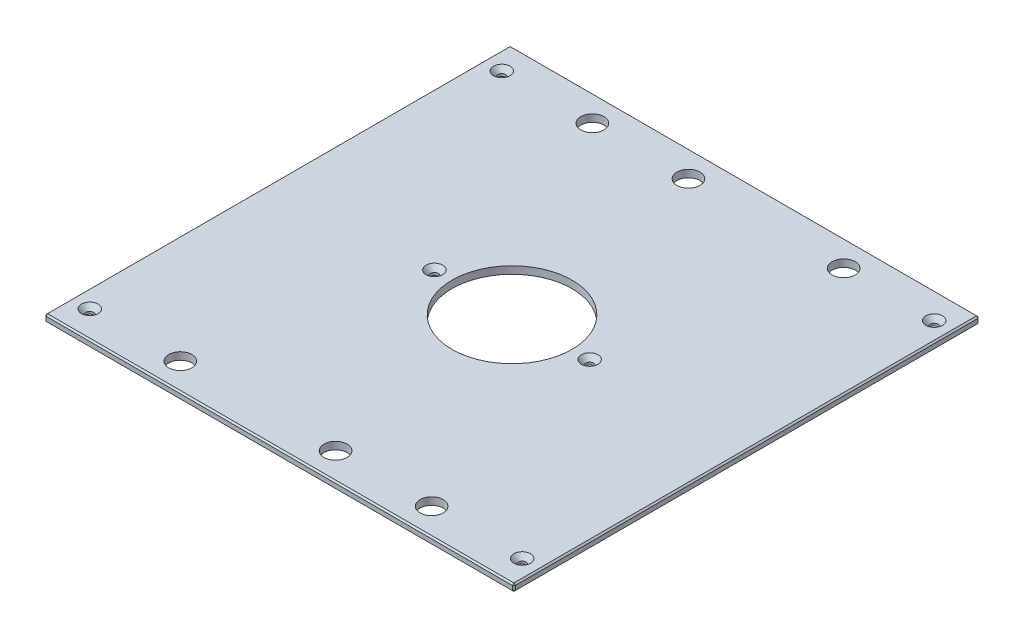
from build123d import *

# Parameters (mm, degrees)
SKETCH1_W                                     = 403.225
SKETCH1_H                                     = 400.05
BOSS_EXTRUDE1_DEPTH                           = 6.35
SKETCH13_R                                    = 51.562
CUT_EXTRUDE6_DEPTH                            = 285.073799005
F_25_32_0_78125_DIAMETER_HOLE1_D              = 19.84375
CHAMFER2_SIZE                                 = 1.27
CSK_FOR_1_4_FLAT_HEAD_MACHINE_SCREW1_AT_COUNT = 2
CSK_FOR_1_4_FLAT_HEAD_MACHINE_SCREW1_AT_PITCH = 354.00996
CSK_FOR_1_4_FLAT_HEAD_MACHINE_SCREW1_2_COUNT  = 2
CSK_FOR_1_4_FLAT_HEAD_MACHINE_SCREW1_2_PITCH  = 513.143963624
CSK_FOR_1_4_FLAT_HEAD_MACHINE_SCREW1_3_COUNT  = 2
CSK_FOR_1_4_FLAT_HEAD_MACHINE_SCREW1_3_PITCH  = 308.290176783
CSK_FOR_1_4_FLAT_HEAD_MACHINE_SCREW1_4_COUNT  = 2
CSK_FOR_1_4_FLAT_HEAD_MACHINE_SCREW1_4_PITCH  = 213.322858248
CSK_FOR_1_4_FLAT_HEAD_MACHINE_SCREW1_5_COUNT  = 2
CSK_FOR_1_4_FLAT_HEAD_MACHINE_SCREW1_5_PITCH  = 371.475
CSK_FOR_1_4_FLAT_HEAD_MACHINE_SCREW1_6_COUNT  = 2
CSK_FOR_1_4_FLAT_HEAD_MACHINE_SCREW1_6_PITCH  = 293.6875
CSK_FOR_1_4_FLAT_HEAD_MACHINE_SCREW1_7_COUNT  = 2
CSK_FOR_1_4_FLAT_HEAD_MACHINE_SCREW1_7_PITCH  = 459.973259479


with BuildPart() as part:
    # Sketch1 → Boss-Extrude1 (new body)
    with BuildSketch(Plane(origin=(0, 0, 0), x_dir=(1, 0, 0), z_dir=(0, 1, 0))):
        Rectangle(SKETCH1_W, SKETCH1_H)
    extrude(amount=BOSS_EXTRUDE1_DEPTH)

    # Sketch13 → Cut-Extrude6 (cut, through all)
    with BuildSketch(Plane(origin=(0, 6.35, 0), x_dir=(1, 0, 0), z_dir=(0, 1, 0))):
        with Locations(Location((0, 0, 0), (0, 0, 270))):
            Circle(SKETCH13_R)
    extrude(amount=-CUT_EXTRUDE6_DEPTH, mode=Mode.SUBTRACT)

    # 25_32 _0.78125_ Diameter Hole1 (through all)
    with Locations(Plane(origin=(0, 6.35, 0), x_dir=(1, 0, 0), z_dir=(0, 1, 0))):
        with Locations((107.95, 177.00498), (-107.95, 177.00498), (107.95, -177.00498), (-107.95, -177.00498), (-25.4, 177.00498), (25.4, -177.00498)):
            Hole(F_25_32_0_78125_DIAMETER_HOLE1_D / 2)

    # Chamfer2
    chamfer2_edges = [part.edges().sort_by_distance(p)[0] for p in [
        (201.6125, 6.35, 0),
        (0, 6.35, -200.025),
        (-201.6125, 6.35, 0),
        (0, 0, -200.025),
        (201.6125, 0, 0),
        (0, 0, 200.025),
        (-201.6125, 0, 0),
        (0, 6.35, 200.025),
        (-201.6125, 3.175, -200.025),
        (201.6125, 3.175, -200.025),
        (201.6125, 3.175, 200.025),
        (-201.6125, 3.175, 200.025),
    ]]
    chamfer(chamfer2_edges, length=CHAMFER2_SIZE)

    # Sketch24 → CSK for 1_4 Flat Head Machine Screw1 (revolve, cut)
    with BuildSketch(Plane(origin=(185.7375, 6.35, -177.00498), x_dir=(0, 0, 1), z_dir=(1, 0, 0))):
        Polygon((0, 0), (0, 6.35), (3.3782, 6.35), (3.3782, 4.324464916), (7.1374, 0), align=None)
    csk_for_1_4_flat_head_machine_screw1 = revolve(axis=Axis((185.7375, 12.7, -177.00498), (0, -1, 0)), mode=Mode.SUBTRACT)

    # CSK for 1_4 Flat Head Machine Screw1 at: CSK for 1_4 Flat Head Machine Screw1 ×2
    with Locations(*[(0, 0, i * CSK_FOR_1_4_FLAT_HEAD_MACHINE_SCREW1_AT_PITCH) for i in range(1, CSK_FOR_1_4_FLAT_HEAD_MACHINE_SCREW1_AT_COUNT)]):
        add(csk_for_1_4_flat_head_machine_screw1, mode=Mode.SUBTRACT)

    # CSK for 1_4 Flat Head Machine Screw1 2: CSK for 1_4 Flat Head Machine Screw1 ×2
    with Locations(*[Vector(-0.7239196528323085, 0, 0.6898842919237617) * (i * CSK_FOR_1_4_FLAT_HEAD_MACHINE_SCREW1_2_PITCH) for i in range(1, CSK_FOR_1_4_FLAT_HEAD_MACHINE_SCREW1_2_COUNT)]):
        add(csk_for_1_4_flat_head_machine_screw1, mode=Mode.SUBTRACT)

    # CSK for 1_4 Flat Head Machine Screw1 3: CSK for 1_4 Flat Head Machine Screw1 ×2
    with Locations(*[Vector(-0.8187497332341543, 0, 0.5741505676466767) * (i * CSK_FOR_1_4_FLAT_HEAD_MACHINE_SCREW1_3_PITCH) for i in range(1, CSK_FOR_1_4_FLAT_HEAD_MACHINE_SCREW1_3_COUNT)]):
        add(csk_for_1_4_flat_head_machine_screw1, mode=Mode.SUBTRACT)

    # CSK for 1_4 Flat Head Machine Screw1 4: CSK for 1_4 Flat Head Machine Screw1 ×2
    with Locations(*[Vector(-0.5581328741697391, 0, 0.8297515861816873) * (i * CSK_FOR_1_4_FLAT_HEAD_MACHINE_SCREW1_4_PITCH) for i in range(1, CSK_FOR_1_4_FLAT_HEAD_MACHINE_SCREW1_4_COUNT)]):
        add(csk_for_1_4_flat_head_machine_screw1, mode=Mode.SUBTRACT)

    # CSK for 1_4 Flat Head Machine Screw1 5: CSK for 1_4 Flat Head Machine Screw1 ×2
    with Locations(*[(-i * CSK_FOR_1_4_FLAT_HEAD_MACHINE_SCREW1_5_PITCH, 0, 0) for i in range(1, CSK_FOR_1_4_FLAT_HEAD_MACHINE_SCREW1_5_COUNT)]):
        add(csk_for_1_4_flat_head_machine_screw1, mode=Mode.SUBTRACT)

    # CSK for 1_4 Flat Head Machine Screw1 6: CSK for 1_4 Flat Head Machine Screw1 ×2
    with Locations(*[(-i * CSK_FOR_1_4_FLAT_HEAD_MACHINE_SCREW1_6_PITCH, 0, 0) for i in range(1, CSK_FOR_1_4_FLAT_HEAD_MACHINE_SCREW1_6_COUNT)]):
        add(csk_for_1_4_flat_head_machine_screw1, mode=Mode.SUBTRACT)

    # CSK for 1_4 Flat Head Machine Screw1 7: CSK for 1_4 Flat Head Machine Screw1 ×2
    with Locations(*[Vector(-0.6384882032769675, 0, 0.7696316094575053) * (i * CSK_FOR_1_4_FLAT_HEAD_MACHINE_SCREW1_7_PITCH) for i in range(1, CSK_FOR_1_4_FLAT_HEAD_MACHINE_SCREW1_7_COUNT)]):
        add(csk_for_1_4_flat_head_machine_screw1, mode=Mode.SUBTRACT)


solid = part.part
